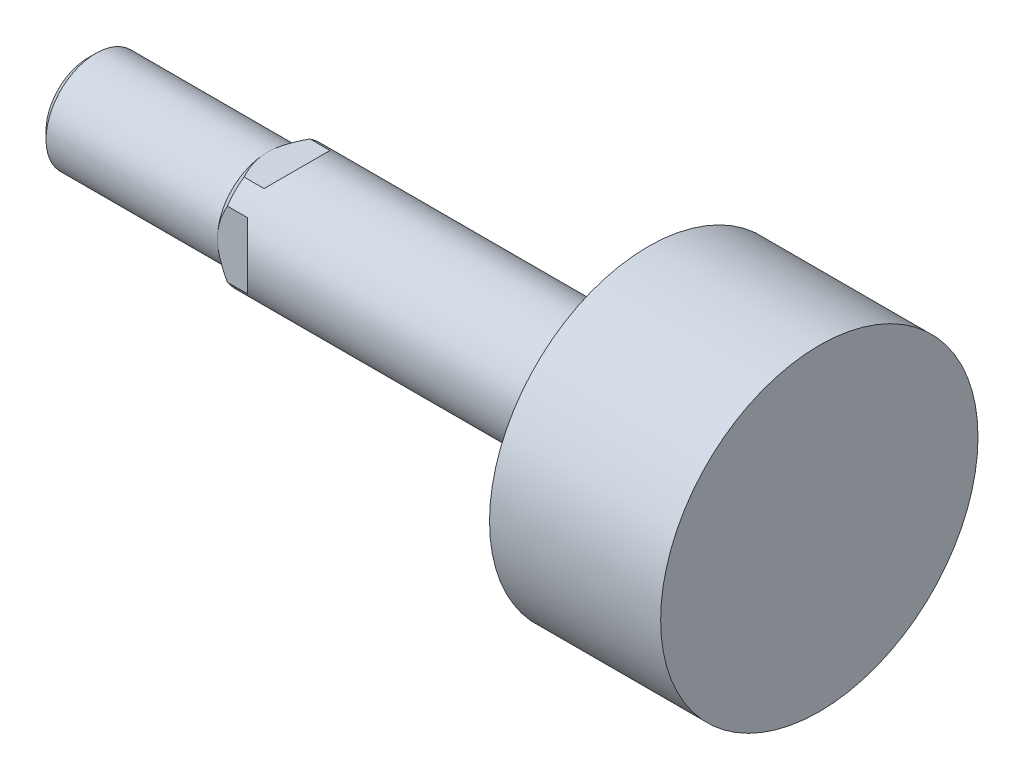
ISO-10303-21;
HEADER;
FILE_DESCRIPTION(('STEP AP214'),'2;1');
FILE_NAME('part.step','',(''),(''),'','','');
FILE_SCHEMA(('AUTOMOTIVE_DESIGN { 1 0 10303 214 1 1 1 1 }'));
ENDSEC;
DATA;
#1=APPLICATION_CONTEXT('core data for automotive mechanical design processes');
#2=APPLICATION_PROTOCOL_DEFINITION('international standard','automotive_design',2000,#1);
#3=PRODUCT_CONTEXT('',#1,'mechanical');
#4=PRODUCT('Part','Part','',(#3));
#5=PRODUCT_RELATED_PRODUCT_CATEGORY('part','',(#4));
#6=PRODUCT_DEFINITION_FORMATION('','',#4);
#7=PRODUCT_DEFINITION_CONTEXT('part definition',#1,'design');
#8=PRODUCT_DEFINITION('design','',#6,#7);
#9=PRODUCT_DEFINITION_SHAPE('','',#8);
#10=(LENGTH_UNIT() NAMED_UNIT(*) SI_UNIT(.MILLI.,.METRE.));
#11=(NAMED_UNIT(*) PLANE_ANGLE_UNIT() SI_UNIT($,.RADIAN.));
#12=(NAMED_UNIT(*) SI_UNIT($,.STERADIAN.) SOLID_ANGLE_UNIT());
#13=UNCERTAINTY_MEASURE_WITH_UNIT(LENGTH_MEASURE(1.E-05),#10,'distance_accuracy_value','');
#14=(GEOMETRIC_REPRESENTATION_CONTEXT(3) GLOBAL_UNCERTAINTY_ASSIGNED_CONTEXT((#13)) GLOBAL_UNIT_ASSIGNED_CONTEXT((#10,
#11,#12)) REPRESENTATION_CONTEXT('',''));
#15=CARTESIAN_POINT('',(0.,0.,0.));
#16=DIRECTION('',(0.,0.,1.));
#17=DIRECTION('',(1.,0.,0.));
#18=AXIS2_PLACEMENT_3D('',#15,#16,#17);
#19=CARTESIAN_POINT('',(-6.,0.,0.));
#20=DIRECTION('',(1.,0.,0.));
#21=DIRECTION('',(0.,0.,-1.));
#22=AXIS2_PLACEMENT_3D('',#19,#20,#21);
#23=CONICAL_SURFACE('',#22,6.,0.785398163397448);
#24=CARTESIAN_POINT('',(-6.,0.,0.));
#25=DIRECTION('',(-1.,0.,0.));
#26=DIRECTION('',(0.,0.,1.));
#27=AXIS2_PLACEMENT_3D('',#24,#25,#26);
#28=CIRCLE('',#27,6.);
#29=CARTESIAN_POINT('',(-6.,3.3166247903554,5.));
#30=VERTEX_POINT('',#29);
#31=CARTESIAN_POINT('',(-6.,5.,3.3166247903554));
#32=VERTEX_POINT('',#31);
#33=EDGE_CURVE('E120',#30,#32,#28,.T.);
#34=ORIENTED_EDGE('',*,*,#33,.T.);
#35=CARTESIAN_POINT('',(-1.60454480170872,5.,-9.11402703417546));
#36=CARTESIAN_POINT('',(-1.79364477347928,5.,-8.89830090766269));
#37=CARTESIAN_POINT('',(-1.98190727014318,5.,-8.68183266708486));
#38=CARTESIAN_POINT('',(-2.35630603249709,5.,-8.24701419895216));
#39=CARTESIAN_POINT('',(-2.54244199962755,5.,-8.02866371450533));
#40=CARTESIAN_POINT('',(-2.91316602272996,5.,-7.58845746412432));
#41=CARTESIAN_POINT('',(-3.09773863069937,5.,-7.36658865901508));
#42=CARTESIAN_POINT('',(-3.46351701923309,5.,-6.92011160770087));
#43=CARTESIAN_POINT('',(-3.6447230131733,5.,-6.6955035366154));
#44=CARTESIAN_POINT('',(-4.01639664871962,5.,-6.22576289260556));
#45=CARTESIAN_POINT('',(-4.20652795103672,5.,-5.98036302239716));
#46=CARTESIAN_POINT('',(-4.58021175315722,5.,-5.48450892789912));
#47=CARTESIAN_POINT('',(-4.76376291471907,5.,-5.23405369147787));
#48=CARTESIAN_POINT('',(-5.12138369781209,5.,-4.72732602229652));
#49=CARTESIAN_POINT('',(-5.29547588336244,5.,-4.47106970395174));
#50=CARTESIAN_POINT('',(-5.54700487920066,5.,-4.08056112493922));
#51=CARTESIAN_POINT('',(-5.62923296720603,5.,-3.94939408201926));
#52=CARTESIAN_POINT('',(-5.78983619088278,5.,-3.68472805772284));
#53=CARTESIAN_POINT('',(-5.86821173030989,5.,-3.55122932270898));
#54=CARTESIAN_POINT('',(-5.99561991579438,5.,-3.32539029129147));
#55=CARTESIAN_POINT('',(-6.04591585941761,5.,-3.23376316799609));
#56=CARTESIAN_POINT('',(-6.14409078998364,5.,-3.04922520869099));
#57=CARTESIAN_POINT('',(-6.19196976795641,5.,-2.95631436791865));
#58=CARTESIAN_POINT('',(-6.33152002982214,5.,-2.6754640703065));
#59=CARTESIAN_POINT('',(-6.41908451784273,5.,-2.48544199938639));
#60=CARTESIAN_POINT('',(-6.57902142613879,5.,-2.10167883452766));
#61=CARTESIAN_POINT('',(-6.65156138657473,5.,-1.90800837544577));
#62=CARTESIAN_POINT('',(-6.77885149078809,5.,-1.51488105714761));
#63=CARTESIAN_POINT('',(-6.83361207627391,5.,-1.31542766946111));
#64=CARTESIAN_POINT('',(-6.90932037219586,5.,-0.967191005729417));
#65=CARTESIAN_POINT('',(-6.93542358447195,5.,-0.819529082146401));
#66=CARTESIAN_POINT('',(-6.97492435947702,5.,-0.52251362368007));
#67=CARTESIAN_POINT('',(-6.98832463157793,5.,-0.373160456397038));
#68=CARTESIAN_POINT('',(-7.00167808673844,5.,-0.0741041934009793));
#69=CARTESIAN_POINT('',(-7.00165451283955,5.,0.0755978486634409));
#70=CARTESIAN_POINT('',(-6.98822522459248,5.,0.374410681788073));
#71=CARTESIAN_POINT('',(-6.97481717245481,5.,0.523521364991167));
#72=CARTESIAN_POINT('',(-6.93107757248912,5.,0.851961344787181));
#73=CARTESIAN_POINT('',(-6.89772509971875,5.,1.03088843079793));
#74=CARTESIAN_POINT('',(-6.81461946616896,5.,1.38486287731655));
#75=CARTESIAN_POINT('',(-6.76486062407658,5.,1.55990887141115));
#76=CARTESIAN_POINT('',(-6.65082104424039,5.,1.90820327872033));
#77=CARTESIAN_POINT('',(-6.58632421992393,5.,2.08138012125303));
#78=CARTESIAN_POINT('',(-6.48110877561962,5.,2.33756680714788));
#79=CARTESIAN_POINT('',(-6.44462869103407,5.,2.42235894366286));
#80=CARTESIAN_POINT('',(-6.36913788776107,5.,2.59080554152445));
#81=CARTESIAN_POINT('',(-6.33012729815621,5.,2.67446006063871));
#82=CARTESIAN_POINT('',(-6.2034832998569,5.,2.93670685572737));
#83=CARTESIAN_POINT('',(-6.11174535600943,5.,3.11332251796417));
#84=CARTESIAN_POINT('',(-5.9201216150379,5.,3.46210204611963));
#85=CARTESIAN_POINT('',(-5.82023294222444,5.,3.63426431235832));
#86=CARTESIAN_POINT('',(-5.61394517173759,5.,3.97493273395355));
#87=CARTESIAN_POINT('',(-5.50753772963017,5.,4.14343381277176));
#88=CARTESIAN_POINT('',(-5.289676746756,5.,4.47709665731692));
#89=CARTESIAN_POINT('',(-5.17822379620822,5.,4.64225881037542));
#90=CARTESIAN_POINT('',(-4.95054702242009,5.,4.97080519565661));
#91=CARTESIAN_POINT('',(-4.83429742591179,5.,5.13417151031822));
#92=CARTESIAN_POINT('',(-4.59846600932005,5.,5.45848543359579));
#93=CARTESIAN_POINT('',(-4.47888402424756,5.,5.6194329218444));
#94=CARTESIAN_POINT('',(-4.1162542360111,5.,6.09896717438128));
#95=CARTESIAN_POINT('',(-3.8691523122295,5.,6.41448750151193));
#96=CARTESIAN_POINT('',(-3.39688153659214,5.,7.00289492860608));
#97=CARTESIAN_POINT('',(-3.17253372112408,5.,7.27644693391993));
#98=CARTESIAN_POINT('',(-2.71942355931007,5.,7.8199503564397));
#99=CARTESIAN_POINT('',(-2.4906604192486,5.,8.08990111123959));
#100=CARTESIAN_POINT('',(-2.03285231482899,5.,8.62337380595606));
#101=CARTESIAN_POINT('',(-1.80385124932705,5.,8.88693353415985));
#102=CARTESIAN_POINT('',(-1.3433228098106,5.,9.41170985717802));
#103=CARTESIAN_POINT('',(-1.11179614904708,5.,9.67292707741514));
#104=CARTESIAN_POINT('',(-0.87930384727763,5.,9.93327151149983));
#105=B_SPLINE_CURVE_WITH_KNOTS('',3,(#35,#36,#37,#38,#39,#40,#41,#42,#43,#44,#45,#46,#47,#48,
#49,#50,#51,#52,#53,#54,#55,#56,#57,#58,#59,#60,#61,#62,#63,#64,#65,#66,#67,#68,#69,#70,#71,#72,
#73,#74,#75,#76,#77,#78,#79,#80,#81,#82,#83,#84,#85,#86,#87,#88,#89,#90,#91,#92,#93,#94,#95,#96,
#97,#98,#99,#100,#101,#102,#103,#104),.UNSPECIFIED.,.F.,.F.,(4,2,2,2,2,2,2,2,2,2,2,2,2,2,2,2,2,
2,2,2,2,2,2,2,2,2,2,2,2,2,2,2,2,2,4),(0.,0.860628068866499,1.72137551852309,2.58716357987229,
3.45289657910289,4.38412013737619,5.31553202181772,6.24461457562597,6.70899557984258,
7.17332781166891,7.48686552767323,7.8004044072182,8.42760354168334,9.04737944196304,
9.66679069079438,10.1161584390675,10.5654303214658,11.0139243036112,11.4624966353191,
12.0075988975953,12.552890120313,13.1067574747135,13.3836444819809,13.6605173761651,
14.2572699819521,14.8542340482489,15.4519789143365,16.0496540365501,16.6511194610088,
17.252614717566,18.4547185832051,19.5160214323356,20.5775168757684,21.6249470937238,
22.6720887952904),.UNSPECIFIED.);
#106=CARTESIAN_POINT('',(-7.,5.,0.));
#107=VERTEX_POINT('',#106);
#108=EDGE_CURVE('E230',#32,#107,#105,.F.);
#109=ORIENTED_EDGE('',*,*,#108,.T.);
#110=CARTESIAN_POINT('',(-7.,0.,0.));
#111=DIRECTION('',(-1.,0.,0.));
#112=DIRECTION('',(0.,0.,1.));
#113=AXIS2_PLACEMENT_3D('',#110,#111,#112);
#114=CIRCLE('',#113,5.);
#115=CARTESIAN_POINT('',(-7.,0.,5.));
#116=VERTEX_POINT('',#115);
#117=EDGE_CURVE('E126',#116,#107,#114,.T.);
#118=ORIENTED_EDGE('',*,*,#117,.F.);
#119=CARTESIAN_POINT('',(-0.991657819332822,-9.80732366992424,5.));
#120=CARTESIAN_POINT('',(-1.19308598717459,-9.58119349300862,5.));
#121=CARTESIAN_POINT('',(-1.39374916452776,-9.3543754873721,5.));
#122=CARTESIAN_POINT('',(-1.79313740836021,-8.89899928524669,5.));
#123=CARTESIAN_POINT('',(-1.9918622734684,-8.67044091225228,5.));
#124=CARTESIAN_POINT('',(-2.38775313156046,-8.21030230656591,5.));
#125=CARTESIAN_POINT('',(-2.58490908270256,-7.97871341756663,5.));
#126=CARTESIAN_POINT('',(-2.97618633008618,-7.51300057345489,5.));
#127=CARTESIAN_POINT('',(-3.17030776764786,-7.278876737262,5.));
#128=CARTESIAN_POINT('',(-3.56622965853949,-6.79333741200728,5.));
#129=CARTESIAN_POINT('',(-3.76779214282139,-6.54172718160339,5.));
#130=CARTESIAN_POINT('',(-4.16517546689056,-6.03402447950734,5.));
#131=CARTESIAN_POINT('',(-4.36099666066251,-5.77793228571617,5.));
#132=CARTESIAN_POINT('',(-4.74456171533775,-5.26038239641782,5.));
#133=CARTESIAN_POINT('',(-4.93231861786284,-4.99893445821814,5.));
#134=CARTESIAN_POINT('',(-5.20576313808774,-4.60117964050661,5.));
#135=CARTESIAN_POINT('',(-5.29553526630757,-4.46768156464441,5.));
#136=CARTESIAN_POINT('',(-5.4717999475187,-4.1985412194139,5.));
#137=CARTESIAN_POINT('',(-5.55829262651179,-4.06289903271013,5.));
#138=CARTESIAN_POINT('',(-5.76184057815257,-3.73331659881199,5.));
#139=CARTESIAN_POINT('',(-5.87696553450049,-3.53817282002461,5.));
#140=CARTESIAN_POINT('',(-6.09699630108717,-3.14206624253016,5.));
#141=CARTESIAN_POINT('',(-6.2018988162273,-2.94110159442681,5.));
#142=CARTESIAN_POINT('',(-6.39721135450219,-2.53432452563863,5.));
#143=CARTESIAN_POINT('',(-6.487739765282,-2.32856965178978,5.));
#144=CARTESIAN_POINT('',(-6.65102786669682,-1.91010569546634,5.));
#145=CARTESIAN_POINT('',(-6.72379941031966,-1.69740135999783,5.));
#146=CARTESIAN_POINT('',(-6.82651229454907,-1.33583757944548,5.));
#147=CARTESIAN_POINT('',(-6.86268358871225,-1.18875094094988,5.));
#148=CARTESIAN_POINT('',(-6.92310669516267,-0.892133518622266,5.));
#149=CARTESIAN_POINT('',(-6.947360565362,-0.742603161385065,5.));
#150=CARTESIAN_POINT('',(-6.98265981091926,-0.442508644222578,5.));
#151=CARTESIAN_POINT('',(-6.9937518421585,-0.29195005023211,5.));
#152=CARTESIAN_POINT('',(-7.00226176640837,0.00956074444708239,5.));
#153=CARTESIAN_POINT('',(-6.99967962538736,0.160512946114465,5.));
#154=CARTESIAN_POINT('',(-6.98103618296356,0.460821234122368,5.));
#155=CARTESIAN_POINT('',(-6.96504136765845,0.610181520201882,5.));
#156=CARTESIAN_POINT('',(-6.92051704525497,0.907029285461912,5.));
#157=CARTESIAN_POINT('',(-6.89198456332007,1.05451631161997,5.));
#158=CARTESIAN_POINT('',(-6.82334280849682,1.34850138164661,5.));
#159=CARTESIAN_POINT('',(-6.78310600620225,1.49496927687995,5.));
#160=CARTESIAN_POINT('',(-6.69279349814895,1.78477023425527,5.));
#161=CARTESIAN_POINT('',(-6.64271960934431,1.92810386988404,5.));
#162=CARTESIAN_POINT('',(-6.5163267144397,2.25856233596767,5.));
#163=CARTESIAN_POINT('',(-6.43680941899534,2.4444583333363,5.));
#164=CARTESIAN_POINT('',(-6.26631467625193,2.81095841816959,5.));
#165=CARTESIAN_POINT('',(-6.17533094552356,2.99155953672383,5.));
#166=CARTESIAN_POINT('',(-5.98414651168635,3.348627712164,5.));
#167=CARTESIAN_POINT('',(-5.88391331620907,3.52507723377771,5.));
#168=CARTESIAN_POINT('',(-5.67651131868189,3.87377641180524,5.));
#169=CARTESIAN_POINT('',(-5.56934386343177,4.04602687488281,5.));
#170=CARTESIAN_POINT('',(-5.35501877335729,4.37848116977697,5.));
#171=CARTESIAN_POINT('',(-5.24812715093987,4.53885738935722,5.));
#172=CARTESIAN_POINT('',(-5.03035517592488,4.85688884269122,5.));
#173=CARTESIAN_POINT('',(-4.91947450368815,5.01454385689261,5.));
#174=CARTESIAN_POINT('',(-4.69547393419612,5.32613837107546,5.));
#175=CARTESIAN_POINT('',(-4.58238248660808,5.48009839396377,5.));
#176=CARTESIAN_POINT('',(-4.35358630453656,5.78600281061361,5.));
#177=CARTESIAN_POINT('',(-4.23788227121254,5.93794772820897,5.));
#178=CARTESIAN_POINT('',(-4.12112335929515,6.08906373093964,5.));
#179=B_SPLINE_CURVE_WITH_KNOTS('',3,(#119,#120,#121,#122,#123,#124,#125,#126,#127,#128,#129,
#130,#131,#132,#133,#134,#135,#136,#137,#138,#139,#140,#141,#142,#143,#144,#145,#146,#147,#148,
#149,#150,#151,#152,#153,#154,#155,#156,#157,#158,#159,#160,#161,#162,#163,#164,#165,#166,#167,
#168,#169,#170,#171,#172,#173,#174,#175,#176,#177,#178),.UNSPECIFIED.,.F.,.F.,(4,2,2,2,2,2,2,2,
2,2,2,2,2,2,2,2,2,2,2,2,2,2,2,2,2,2,2,2,2,4),(0.,0.908506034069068,1.81710546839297,
2.72951794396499,3.6418878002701,4.60899241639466,5.57603727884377,6.54145432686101,
7.02404000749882,7.50660712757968,8.18608499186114,8.86578115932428,9.53955092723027,
10.2128697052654,10.6668587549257,11.1207693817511,11.5730661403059,12.0253640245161,
12.4754330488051,12.9256089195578,13.3808863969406,13.8360798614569,14.4421198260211,
15.0484933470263,15.6570845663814,16.2655579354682,16.8436881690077,17.421864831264,
17.9949317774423,18.5678467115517),.UNSPECIFIED.);
#180=EDGE_CURVE('E146',#116,#30,#179,.T.);
#181=ORIENTED_EDGE('',*,*,#180,.T.);
#182=EDGE_LOOP('',(#34,#109,#118,#181));
#183=FACE_BOUND('',#182,.T.);
#184=ADVANCED_FACE('F16',(#183),#23,.T.);
#185=CARTESIAN_POINT('',(-6.,-3.3166247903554,-5.));
#186=VERTEX_POINT('',#185);
#187=CARTESIAN_POINT('',(-6.,-5.,-3.3166247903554));
#188=VERTEX_POINT('',#187);
#189=EDGE_CURVE('E109',#186,#188,#28,.T.);
#190=ORIENTED_EDGE('',*,*,#189,.T.);
#191=CARTESIAN_POINT('',(-1.60454480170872,-5.,-9.11402703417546));
#192=CARTESIAN_POINT('',(-1.79364477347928,-5.,-8.89830090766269));
#193=CARTESIAN_POINT('',(-1.98190727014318,-5.,-8.68183266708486));
#194=CARTESIAN_POINT('',(-2.35630603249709,-5.,-8.24701419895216));
#195=CARTESIAN_POINT('',(-2.54244199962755,-5.,-8.02866371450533));
#196=CARTESIAN_POINT('',(-2.91316602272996,-5.,-7.58845746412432));
#197=CARTESIAN_POINT('',(-3.09773863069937,-5.,-7.36658865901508));
#198=CARTESIAN_POINT('',(-3.46351701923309,-5.,-6.92011160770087));
#199=CARTESIAN_POINT('',(-3.6447230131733,-5.,-6.6955035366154));
#200=CARTESIAN_POINT('',(-4.01639664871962,-5.,-6.22576289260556));
#201=CARTESIAN_POINT('',(-4.20652795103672,-5.,-5.98036302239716));
#202=CARTESIAN_POINT('',(-4.58021175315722,-5.,-5.48450892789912));
#203=CARTESIAN_POINT('',(-4.76376291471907,-5.,-5.23405369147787));
#204=CARTESIAN_POINT('',(-5.12138369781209,-5.,-4.72732602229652));
#205=CARTESIAN_POINT('',(-5.29547588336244,-5.,-4.47106970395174));
#206=CARTESIAN_POINT('',(-5.54700487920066,-5.,-4.08056112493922));
#207=CARTESIAN_POINT('',(-5.62923296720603,-5.,-3.94939408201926));
#208=CARTESIAN_POINT('',(-5.78983619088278,-5.,-3.68472805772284));
#209=CARTESIAN_POINT('',(-5.86821173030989,-5.,-3.55122932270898));
#210=CARTESIAN_POINT('',(-5.99561991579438,-5.,-3.32539029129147));
#211=CARTESIAN_POINT('',(-6.04591585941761,-5.,-3.23376316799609));
#212=CARTESIAN_POINT('',(-6.14409078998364,-5.,-3.04922520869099));
#213=CARTESIAN_POINT('',(-6.19196976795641,-5.,-2.95631436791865));
#214=CARTESIAN_POINT('',(-6.33152002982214,-5.,-2.6754640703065));
#215=CARTESIAN_POINT('',(-6.41908451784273,-5.,-2.48544199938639));
#216=CARTESIAN_POINT('',(-6.57902142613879,-5.,-2.10167883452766));
#217=CARTESIAN_POINT('',(-6.65156138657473,-5.,-1.90800837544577));
#218=CARTESIAN_POINT('',(-6.77885149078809,-5.,-1.51488105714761));
#219=CARTESIAN_POINT('',(-6.83361207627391,-5.,-1.31542766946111));
#220=CARTESIAN_POINT('',(-6.90932037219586,-5.,-0.967191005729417));
#221=CARTESIAN_POINT('',(-6.93542358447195,-5.,-0.819529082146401));
#222=CARTESIAN_POINT('',(-6.97492435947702,-5.,-0.52251362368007));
#223=CARTESIAN_POINT('',(-6.98832463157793,-5.,-0.373160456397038));
#224=CARTESIAN_POINT('',(-7.00167808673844,-5.,-0.0741041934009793));
#225=CARTESIAN_POINT('',(-7.00165451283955,-5.,0.0755978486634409));
#226=CARTESIAN_POINT('',(-6.98822522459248,-5.,0.374410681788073));
#227=CARTESIAN_POINT('',(-6.97481717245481,-5.,0.523521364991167));
#228=CARTESIAN_POINT('',(-6.93107757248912,-5.,0.851961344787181));
#229=CARTESIAN_POINT('',(-6.89772509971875,-5.,1.03088843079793));
#230=CARTESIAN_POINT('',(-6.81461946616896,-5.,1.38486287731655));
#231=CARTESIAN_POINT('',(-6.76486062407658,-5.,1.55990887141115));
#232=CARTESIAN_POINT('',(-6.65082104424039,-5.,1.90820327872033));
#233=CARTESIAN_POINT('',(-6.58632421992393,-5.,2.08138012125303));
#234=CARTESIAN_POINT('',(-6.48110877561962,-5.,2.33756680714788));
#235=CARTESIAN_POINT('',(-6.44462869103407,-5.,2.42235894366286));
#236=CARTESIAN_POINT('',(-6.36913788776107,-5.,2.59080554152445));
#237=CARTESIAN_POINT('',(-6.33012729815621,-5.,2.67446006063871));
#238=CARTESIAN_POINT('',(-6.2034832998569,-5.,2.93670685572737));
#239=CARTESIAN_POINT('',(-6.11174535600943,-5.,3.11332251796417));
#240=CARTESIAN_POINT('',(-5.9201216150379,-5.,3.46210204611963));
#241=CARTESIAN_POINT('',(-5.82023294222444,-5.,3.63426431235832));
#242=CARTESIAN_POINT('',(-5.61394517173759,-5.,3.97493273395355));
#243=CARTESIAN_POINT('',(-5.50753772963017,-5.,4.14343381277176));
#244=CARTESIAN_POINT('',(-5.289676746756,-5.,4.47709665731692));
#245=CARTESIAN_POINT('',(-5.17822379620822,-5.,4.64225881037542));
#246=CARTESIAN_POINT('',(-4.95054702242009,-5.,4.97080519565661));
#247=CARTESIAN_POINT('',(-4.83429742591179,-5.,5.13417151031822));
#248=CARTESIAN_POINT('',(-4.59846600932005,-5.,5.45848543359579));
#249=CARTESIAN_POINT('',(-4.47888402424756,-5.,5.6194329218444));
#250=CARTESIAN_POINT('',(-4.1162542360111,-5.,6.09896717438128));
#251=CARTESIAN_POINT('',(-3.8691523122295,-5.,6.41448750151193));
#252=CARTESIAN_POINT('',(-3.39688153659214,-5.,7.00289492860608));
#253=CARTESIAN_POINT('',(-3.17253372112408,-5.,7.27644693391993));
#254=CARTESIAN_POINT('',(-2.71942355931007,-5.,7.8199503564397));
#255=CARTESIAN_POINT('',(-2.4906604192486,-5.,8.08990111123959));
#256=CARTESIAN_POINT('',(-2.03285231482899,-5.,8.62337380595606));
#257=CARTESIAN_POINT('',(-1.80385124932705,-5.,8.88693353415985));
#258=CARTESIAN_POINT('',(-1.3433228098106,-5.,9.41170985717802));
#259=CARTESIAN_POINT('',(-1.11179614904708,-5.,9.67292707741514));
#260=CARTESIAN_POINT('',(-0.87930384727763,-5.,9.93327151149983));
#261=B_SPLINE_CURVE_WITH_KNOTS('',3,(#191,#192,#193,#194,#195,#196,#197,#198,#199,#200,#201,
#202,#203,#204,#205,#206,#207,#208,#209,#210,#211,#212,#213,#214,#215,#216,#217,#218,#219,#220,
#221,#222,#223,#224,#225,#226,#227,#228,#229,#230,#231,#232,#233,#234,#235,#236,#237,#238,#239,
#240,#241,#242,#243,#244,#245,#246,#247,#248,#249,#250,#251,#252,#253,#254,#255,#256,#257,#258,
#259,#260),.UNSPECIFIED.,.F.,.F.,(4,2,2,2,2,2,2,2,2,2,2,2,2,2,2,2,2,2,2,2,2,2,2,2,2,2,2,2,2,2,2,
2,2,2,4),(0.,0.860628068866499,1.72137551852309,2.58716357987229,3.45289657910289,
4.38412013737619,5.31553202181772,6.24461457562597,6.70899557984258,7.17332781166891,
7.48686552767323,7.8004044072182,8.42760354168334,9.04737944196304,9.66679069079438,
10.1161584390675,10.5654303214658,11.0139243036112,11.4624966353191,12.0075988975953,
12.552890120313,13.1067574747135,13.3836444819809,13.6605173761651,14.2572699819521,
14.8542340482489,15.4519789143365,16.0496540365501,16.6511194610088,17.252614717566,
18.4547185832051,19.5160214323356,20.5775168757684,21.6249470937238,22.6720887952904),.UNSPECIFIED.);
#262=CARTESIAN_POINT('',(-7.,-5.,0.));
#263=VERTEX_POINT('',#262);
#264=EDGE_CURVE('E94',#188,#263,#261,.T.);
#265=ORIENTED_EDGE('',*,*,#264,.T.);
#266=CARTESIAN_POINT('',(-7.,0.,-5.));
#267=VERTEX_POINT('',#266);
#268=EDGE_CURVE('E107',#267,#263,#114,.T.);
#269=ORIENTED_EDGE('',*,*,#268,.F.);
#270=CARTESIAN_POINT('',(-0.991657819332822,-9.80732366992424,-5.));
#271=CARTESIAN_POINT('',(-1.19308598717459,-9.58119349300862,-5.));
#272=CARTESIAN_POINT('',(-1.39374916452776,-9.3543754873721,-5.));
#273=CARTESIAN_POINT('',(-1.79313740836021,-8.89899928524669,-5.));
#274=CARTESIAN_POINT('',(-1.9918622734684,-8.67044091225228,-5.));
#275=CARTESIAN_POINT('',(-2.38775313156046,-8.21030230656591,-5.));
#276=CARTESIAN_POINT('',(-2.58490908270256,-7.97871341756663,-5.));
#277=CARTESIAN_POINT('',(-2.97618633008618,-7.51300057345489,-5.));
#278=CARTESIAN_POINT('',(-3.17030776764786,-7.278876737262,-5.));
#279=CARTESIAN_POINT('',(-3.56622965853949,-6.79333741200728,-5.));
#280=CARTESIAN_POINT('',(-3.76779214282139,-6.54172718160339,-5.));
#281=CARTESIAN_POINT('',(-4.16517546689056,-6.03402447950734,-5.));
#282=CARTESIAN_POINT('',(-4.36099666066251,-5.77793228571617,-5.));
#283=CARTESIAN_POINT('',(-4.74456171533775,-5.26038239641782,-5.));
#284=CARTESIAN_POINT('',(-4.93231861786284,-4.99893445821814,-5.));
#285=CARTESIAN_POINT('',(-5.20576313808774,-4.60117964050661,-5.));
#286=CARTESIAN_POINT('',(-5.29553526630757,-4.46768156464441,-5.));
#287=CARTESIAN_POINT('',(-5.4717999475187,-4.1985412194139,-5.));
#288=CARTESIAN_POINT('',(-5.55829262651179,-4.06289903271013,-5.));
#289=CARTESIAN_POINT('',(-5.76184057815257,-3.73331659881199,-5.));
#290=CARTESIAN_POINT('',(-5.87696553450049,-3.53817282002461,-5.));
#291=CARTESIAN_POINT('',(-6.09699630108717,-3.14206624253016,-5.));
#292=CARTESIAN_POINT('',(-6.2018988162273,-2.94110159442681,-5.));
#293=CARTESIAN_POINT('',(-6.39721135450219,-2.53432452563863,-5.));
#294=CARTESIAN_POINT('',(-6.487739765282,-2.32856965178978,-5.));
#295=CARTESIAN_POINT('',(-6.65102786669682,-1.91010569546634,-5.));
#296=CARTESIAN_POINT('',(-6.72379941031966,-1.69740135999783,-5.));
#297=CARTESIAN_POINT('',(-6.82651229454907,-1.33583757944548,-5.));
#298=CARTESIAN_POINT('',(-6.86268358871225,-1.18875094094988,-5.));
#299=CARTESIAN_POINT('',(-6.92310669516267,-0.892133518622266,-5.));
#300=CARTESIAN_POINT('',(-6.947360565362,-0.742603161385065,-5.));
#301=CARTESIAN_POINT('',(-6.98265981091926,-0.442508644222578,-5.));
#302=CARTESIAN_POINT('',(-6.9937518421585,-0.29195005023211,-5.));
#303=CARTESIAN_POINT('',(-7.00226176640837,0.00956074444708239,-5.));
#304=CARTESIAN_POINT('',(-6.99967962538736,0.160512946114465,-5.));
#305=CARTESIAN_POINT('',(-6.98103618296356,0.460821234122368,-5.));
#306=CARTESIAN_POINT('',(-6.96504136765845,0.610181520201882,-5.));
#307=CARTESIAN_POINT('',(-6.92051704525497,0.907029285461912,-5.));
#308=CARTESIAN_POINT('',(-6.89198456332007,1.05451631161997,-5.));
#309=CARTESIAN_POINT('',(-6.82334280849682,1.34850138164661,-5.));
#310=CARTESIAN_POINT('',(-6.78310600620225,1.49496927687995,-5.));
#311=CARTESIAN_POINT('',(-6.69279349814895,1.78477023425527,-5.));
#312=CARTESIAN_POINT('',(-6.64271960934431,1.92810386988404,-5.));
#313=CARTESIAN_POINT('',(-6.5163267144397,2.25856233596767,-5.));
#314=CARTESIAN_POINT('',(-6.43680941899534,2.4444583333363,-5.));
#315=CARTESIAN_POINT('',(-6.26631467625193,2.81095841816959,-5.));
#316=CARTESIAN_POINT('',(-6.17533094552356,2.99155953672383,-5.));
#317=CARTESIAN_POINT('',(-5.98414651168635,3.348627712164,-5.));
#318=CARTESIAN_POINT('',(-5.88391331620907,3.52507723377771,-5.));
#319=CARTESIAN_POINT('',(-5.67651131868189,3.87377641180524,-5.));
#320=CARTESIAN_POINT('',(-5.56934386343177,4.04602687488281,-5.));
#321=CARTESIAN_POINT('',(-5.35501877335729,4.37848116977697,-5.));
#322=CARTESIAN_POINT('',(-5.24812715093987,4.53885738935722,-5.));
#323=CARTESIAN_POINT('',(-5.03035517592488,4.85688884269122,-5.));
#324=CARTESIAN_POINT('',(-4.91947450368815,5.01454385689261,-5.));
#325=CARTESIAN_POINT('',(-4.69547393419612,5.32613837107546,-5.));
#326=CARTESIAN_POINT('',(-4.58238248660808,5.48009839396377,-5.));
#327=CARTESIAN_POINT('',(-4.35358630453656,5.78600281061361,-5.));
#328=CARTESIAN_POINT('',(-4.23788227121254,5.93794772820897,-5.));
#329=CARTESIAN_POINT('',(-4.12112335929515,6.08906373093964,-5.));
#330=B_SPLINE_CURVE_WITH_KNOTS('',3,(#270,#271,#272,#273,#274,#275,#276,#277,#278,#279,#280,
#281,#282,#283,#284,#285,#286,#287,#288,#289,#290,#291,#292,#293,#294,#295,#296,#297,#298,#299,
#300,#301,#302,#303,#304,#305,#306,#307,#308,#309,#310,#311,#312,#313,#314,#315,#316,#317,#318,
#319,#320,#321,#322,#323,#324,#325,#326,#327,#328,#329),.UNSPECIFIED.,.F.,.F.,(4,2,2,2,2,2,2,2,
2,2,2,2,2,2,2,2,2,2,2,2,2,2,2,2,2,2,2,2,2,4),(0.,0.908506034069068,1.81710546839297,
2.72951794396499,3.6418878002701,4.60899241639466,5.57603727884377,6.54145432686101,
7.02404000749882,7.50660712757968,8.18608499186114,8.86578115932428,9.53955092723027,
10.2128697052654,10.6668587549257,11.1207693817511,11.5730661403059,12.0253640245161,
12.4754330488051,12.9256089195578,13.3808863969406,13.8360798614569,14.4421198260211,
15.0484933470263,15.6570845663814,16.2655579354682,16.8436881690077,17.421864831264,
17.9949317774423,18.5678467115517),.UNSPECIFIED.);
#331=EDGE_CURVE('E155',#267,#186,#330,.F.);
#332=ORIENTED_EDGE('',*,*,#331,.T.);
#333=EDGE_LOOP('',(#190,#265,#269,#332));
#334=FACE_BOUND('',#333,.T.);
#335=ADVANCED_FACE('F104',(#334),#23,.T.);
#336=EDGE_CURVE('E122',#107,#267,#114,.T.);
#337=ORIENTED_EDGE('',*,*,#336,.F.);
#338=CARTESIAN_POINT('',(-6.,5.,-3.3166247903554));
#339=VERTEX_POINT('',#338);
#340=EDGE_CURVE('E209',#107,#339,#105,.F.);
#341=ORIENTED_EDGE('',*,*,#340,.T.);
#342=CARTESIAN_POINT('',(-6.,3.3166247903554,-5.));
#343=VERTEX_POINT('',#342);
#344=EDGE_CURVE('E213',#339,#343,#28,.T.);
#345=ORIENTED_EDGE('',*,*,#344,.T.);
#346=EDGE_CURVE('E212',#343,#267,#330,.F.);
#347=ORIENTED_EDGE('',*,*,#346,.T.);
#348=EDGE_LOOP('',(#337,#341,#345,#347));
#349=FACE_BOUND('',#348,.T.);
#350=ADVANCED_FACE('F189',(#349),#23,.T.);
#351=CARTESIAN_POINT('',(48.5,0.,0.));
#352=DIRECTION('',(-1.,0.,0.));
#353=DIRECTION('',(0.,0.,1.));
#354=AXIS2_PLACEMENT_3D('',#351,#352,#353);
#355=CYLINDRICAL_SURFACE('',#354,6.);
#356=CARTESIAN_POINT('',(31.3,0.,0.));
#357=DIRECTION('',(-1.,0.,0.));
#358=DIRECTION('',(0.,0.,1.));
#359=AXIS2_PLACEMENT_3D('',#356,#357,#358);
#360=CIRCLE('',#359,6.);
#361=CARTESIAN_POINT('',(31.3,0.,6.));
#362=VERTEX_POINT('',#361);
#363=EDGE_CURVE('E143',#362,#362,#360,.T.);
#364=ORIENTED_EDGE('',*,*,#363,.T.);
#365=EDGE_LOOP('',(#364));
#366=FACE_BOUND('',#365,.T.);
#367=CARTESIAN_POINT('',(-9.,0.,0.));
#368=DIRECTION('',(0.707106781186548,-0.707106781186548,0.));
#369=DIRECTION('',(-0.707106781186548,-0.707106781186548,0.));
#370=AXIS2_PLACEMENT_3D('',#367,#368,#369);
#371=ELLIPSE('',#370,8.48528137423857,6.);
#372=CARTESIAN_POINT('',(-4.,5.,-3.3166247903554));
#373=VERTEX_POINT('',#372);
#374=CARTESIAN_POINT('',(-4.,5.,3.3166247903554));
#375=VERTEX_POINT('',#374);
#376=EDGE_CURVE('E24',#373,#375,#371,.T.);
#377=ORIENTED_EDGE('',*,*,#376,.T.);
#378=DIRECTION('',(-1.,0.,0.));
#379=VECTOR('',#378,1.);
#380=CARTESIAN_POINT('',(48.5,5.,3.3166247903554));
#381=LINE('',#380,#379);
#382=EDGE_CURVE('E11',#375,#32,#381,.T.);
#383=ORIENTED_EDGE('',*,*,#382,.T.);
#384=ORIENTED_EDGE('',*,*,#33,.F.);
#385=DIRECTION('',(-1.,0.,0.));
#386=VECTOR('',#385,1.);
#387=CARTESIAN_POINT('',(48.5,3.3166247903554,5.));
#388=LINE('',#387,#386);
#389=CARTESIAN_POINT('',(-4.,3.31662479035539,5.));
#390=VERTEX_POINT('',#389);
#391=EDGE_CURVE('E232',#30,#390,#388,.F.);
#392=ORIENTED_EDGE('',*,*,#391,.T.);
#393=CARTESIAN_POINT('',(-9.,0.,0.));
#394=DIRECTION('',(0.707106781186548,0.,-0.707106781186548));
#395=DIRECTION('',(-0.707106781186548,0.,-0.707106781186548));
#396=AXIS2_PLACEMENT_3D('',#393,#394,#395);
#397=ELLIPSE('',#396,8.48528137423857,6.);
#398=CARTESIAN_POINT('',(-4.,-3.31662479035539,5.));
#399=VERTEX_POINT('',#398);
#400=EDGE_CURVE('E216',#390,#399,#397,.T.);
#401=ORIENTED_EDGE('',*,*,#400,.T.);
#402=DIRECTION('',(-1.,0.,0.));
#403=VECTOR('',#402,1.);
#404=CARTESIAN_POINT('',(48.5,-3.3166247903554,5.));
#405=LINE('',#404,#403);
#406=CARTESIAN_POINT('',(-6.,-3.3166247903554,5.));
#407=VERTEX_POINT('',#406);
#408=EDGE_CURVE('E269',#399,#407,#405,.T.);
#409=ORIENTED_EDGE('',*,*,#408,.T.);
#410=CARTESIAN_POINT('',(-6.,-5.,3.3166247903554));
#411=VERTEX_POINT('',#410);
#412=EDGE_CURVE('E225',#411,#407,#28,.T.);
#413=ORIENTED_EDGE('',*,*,#412,.F.);
#414=DIRECTION('',(-1.,0.,0.));
#415=VECTOR('',#414,1.);
#416=CARTESIAN_POINT('',(48.5,-5.,3.3166247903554));
#417=LINE('',#416,#415);
#418=CARTESIAN_POINT('',(-4.,-5.,3.31662479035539));
#419=VERTEX_POINT('',#418);
#420=EDGE_CURVE('E39',#411,#419,#417,.F.);
#421=ORIENTED_EDGE('',*,*,#420,.T.);
#422=CARTESIAN_POINT('',(-9.,0.,0.));
#423=DIRECTION('',(0.707106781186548,0.707106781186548,0.));
#424=DIRECTION('',(-0.707106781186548,0.707106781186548,0.));
#425=AXIS2_PLACEMENT_3D('',#422,#423,#424);
#426=ELLIPSE('',#425,8.48528137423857,6.);
#427=CARTESIAN_POINT('',(-4.,-5.,-3.31662479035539));
#428=VERTEX_POINT('',#427);
#429=EDGE_CURVE('E110',#419,#428,#426,.T.);
#430=ORIENTED_EDGE('',*,*,#429,.T.);
#431=DIRECTION('',(-1.,0.,0.));
#432=VECTOR('',#431,1.);
#433=CARTESIAN_POINT('',(48.5,-5.,-3.3166247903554));
#434=LINE('',#433,#432);
#435=EDGE_CURVE('E224',#428,#188,#434,.T.);
#436=ORIENTED_EDGE('',*,*,#435,.T.);
#437=ORIENTED_EDGE('',*,*,#189,.F.);
#438=DIRECTION('',(-1.,0.,0.));
#439=VECTOR('',#438,1.);
#440=CARTESIAN_POINT('',(48.5,-3.3166247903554,-5.));
#441=LINE('',#440,#439);
#442=CARTESIAN_POINT('',(-4.,-3.3166247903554,-5.));
#443=VERTEX_POINT('',#442);
#444=EDGE_CURVE('E222',#186,#443,#441,.F.);
#445=ORIENTED_EDGE('',*,*,#444,.T.);
#446=CARTESIAN_POINT('',(-9.,0.,0.));
#447=DIRECTION('',(0.707106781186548,0.,0.707106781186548));
#448=DIRECTION('',(-0.707106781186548,0.,0.707106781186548));
#449=AXIS2_PLACEMENT_3D('',#446,#447,#448);
#450=ELLIPSE('',#449,8.48528137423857,6.);
#451=CARTESIAN_POINT('',(-4.,3.3166247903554,-5.));
#452=VERTEX_POINT('',#451);
#453=EDGE_CURVE('E99',#443,#452,#450,.T.);
#454=ORIENTED_EDGE('',*,*,#453,.T.);
#455=DIRECTION('',(-1.,0.,0.));
#456=VECTOR('',#455,1.);
#457=CARTESIAN_POINT('',(48.5,3.3166247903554,-5.));
#458=LINE('',#457,#456);
#459=EDGE_CURVE('E226',#452,#343,#458,.T.);
#460=ORIENTED_EDGE('',*,*,#459,.T.);
#461=ORIENTED_EDGE('',*,*,#344,.F.);
#462=DIRECTION('',(-1.,0.,0.));
#463=VECTOR('',#462,1.);
#464=CARTESIAN_POINT('',(48.5,5.,-3.3166247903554));
#465=LINE('',#464,#463);
#466=EDGE_CURVE('E266',#339,#373,#465,.F.);
#467=ORIENTED_EDGE('',*,*,#466,.T.);
#468=EDGE_LOOP('',(#377,#383,#384,#392,#401,#409,#413,#421,#430,#436,#437,#445,#454,#460,#461,#467));
#469=FACE_BOUND('',#468,.T.);
#470=ADVANCED_FACE('F18',(#366,#469),#355,.T.);
#471=CARTESIAN_POINT('',(31.3,6.,0.));
#472=DIRECTION('',(1.,0.,0.));
#473=DIRECTION('',(0.,0.,-1.));
#474=AXIS2_PLACEMENT_3D('',#471,#472,#473);
#475=PLANE('',#474);
#476=ORIENTED_EDGE('',*,*,#363,.F.);
#477=EDGE_LOOP('',(#476));
#478=FACE_BOUND('',#477,.T.);
#479=CARTESIAN_POINT('',(31.3,0.,0.));
#480=DIRECTION('',(-1.,0.,0.));
#481=DIRECTION('',(0.,0.,1.));
#482=AXIS2_PLACEMENT_3D('',#479,#480,#481);
#483=CIRCLE('',#482,15.95);
#484=CARTESIAN_POINT('',(31.3,0.,15.95));
#485=VERTEX_POINT('',#484);
#486=EDGE_CURVE('E140',#485,#485,#483,.T.);
#487=ORIENTED_EDGE('',*,*,#486,.T.);
#488=EDGE_LOOP('',(#487));
#489=FACE_BOUND('',#488,.T.);
#490=ADVANCED_FACE('F205',(#478,#489),#475,.F.);
#491=CARTESIAN_POINT('',(48.5,0.,0.));
#492=DIRECTION('',(-1.,0.,0.));
#493=DIRECTION('',(0.,0.,1.));
#494=AXIS2_PLACEMENT_3D('',#491,#492,#493);
#495=CYLINDRICAL_SURFACE('',#494,15.95);
#496=ORIENTED_EDGE('',*,*,#486,.F.);
#497=EDGE_LOOP('',(#496));
#498=FACE_BOUND('',#497,.T.);
#499=CARTESIAN_POINT('',(48.5,0.,0.));
#500=DIRECTION('',(-1.,0.,0.));
#501=DIRECTION('',(0.,0.,1.));
#502=AXIS2_PLACEMENT_3D('',#499,#500,#501);
#503=CIRCLE('',#502,15.95);
#504=CARTESIAN_POINT('',(48.5,0.,15.95));
#505=VERTEX_POINT('',#504);
#506=EDGE_CURVE('E135',#505,#505,#503,.T.);
#507=ORIENTED_EDGE('',*,*,#506,.T.);
#508=EDGE_LOOP('',(#507));
#509=FACE_BOUND('',#508,.T.);
#510=ADVANCED_FACE('F340',(#498,#509),#495,.T.);
#511=CARTESIAN_POINT('',(48.5,15.95,0.));
#512=DIRECTION('',(-1.,0.,0.));
#513=DIRECTION('',(0.,0.,1.));
#514=AXIS2_PLACEMENT_3D('',#511,#512,#513);
#515=PLANE('',#514);
#516=ORIENTED_EDGE('',*,*,#506,.F.);
#517=EDGE_LOOP('',(#516));
#518=FACE_BOUND('',#517,.T.);
#519=ADVANCED_FACE('F346',(#518),#515,.F.);
#520=CARTESIAN_POINT('',(-25.,0.,0.));
#521=DIRECTION('',(1.,0.,0.));
#522=DIRECTION('',(0.,0.,-1.));
#523=AXIS2_PLACEMENT_3D('',#520,#521,#522);
#524=PLANE('',#523);
#525=CARTESIAN_POINT('',(-25.,0.,0.));
#526=DIRECTION('',(-1.,0.,0.));
#527=DIRECTION('',(0.,0.,1.));
#528=AXIS2_PLACEMENT_3D('',#525,#526,#527);
#529=CIRCLE('',#528,4.233);
#530=CARTESIAN_POINT('',(-25.,0.,4.233));
#531=VERTEX_POINT('',#530);
#532=EDGE_CURVE('E131',#531,#531,#529,.T.);
#533=ORIENTED_EDGE('',*,*,#532,.T.);
#534=EDGE_LOOP('',(#533));
#535=FACE_BOUND('',#534,.T.);
#536=ADVANCED_FACE('F359',(#535),#524,.F.);
#537=CARTESIAN_POINT('',(-24.233,0.,0.));
#538=DIRECTION('',(1.,0.,0.));
#539=DIRECTION('',(0.,0.,-1.));
#540=AXIS2_PLACEMENT_3D('',#537,#538,#539);
#541=CONICAL_SURFACE('',#540,5.,0.785398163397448);
#542=ORIENTED_EDGE('',*,*,#532,.F.);
#543=EDGE_LOOP('',(#542));
#544=FACE_BOUND('',#543,.T.);
#545=CARTESIAN_POINT('',(-24.233,0.,0.));
#546=DIRECTION('',(-1.,0.,0.));
#547=DIRECTION('',(0.,0.,1.));
#548=AXIS2_PLACEMENT_3D('',#545,#546,#547);
#549=CIRCLE('',#548,5.);
#550=CARTESIAN_POINT('',(-24.233,0.,5.));
#551=VERTEX_POINT('',#550);
#552=EDGE_CURVE('E129',#551,#551,#549,.T.);
#553=ORIENTED_EDGE('',*,*,#552,.T.);
#554=EDGE_LOOP('',(#553));
#555=FACE_BOUND('',#554,.T.);
#556=ADVANCED_FACE('F197',(#544,#555),#541,.T.);
#557=CARTESIAN_POINT('',(0.,0.,0.));
#558=DIRECTION('',(-1.,0.,0.));
#559=DIRECTION('',(0.,0.,1.));
#560=AXIS2_PLACEMENT_3D('',#557,#558,#559);
#561=CYLINDRICAL_SURFACE('',#560,5.);
#562=ORIENTED_EDGE('',*,*,#552,.F.);
#563=EDGE_LOOP('',(#562));
#564=FACE_BOUND('',#563,.T.);
#565=ORIENTED_EDGE('',*,*,#117,.T.);
#566=ORIENTED_EDGE('',*,*,#336,.T.);
#567=ORIENTED_EDGE('',*,*,#268,.T.);
#568=EDGE_CURVE('E112',#263,#116,#114,.T.);
#569=ORIENTED_EDGE('',*,*,#568,.T.);
#570=EDGE_LOOP('',(#565,#566,#567,#569));
#571=FACE_BOUND('',#570,.T.);
#572=ADVANCED_FACE('F123',(#564,#571),#561,.T.);
#573=ORIENTED_EDGE('',*,*,#568,.F.);
#574=EDGE_CURVE('E91',#263,#411,#261,.T.);
#575=ORIENTED_EDGE('',*,*,#574,.T.);
#576=ORIENTED_EDGE('',*,*,#412,.T.);
#577=EDGE_CURVE('E115',#407,#116,#179,.T.);
#578=ORIENTED_EDGE('',*,*,#577,.T.);
#579=EDGE_LOOP('',(#573,#575,#576,#578));
#580=FACE_BOUND('',#579,.T.);
#581=ADVANCED_FACE('F113',(#580),#23,.T.);
#582=CARTESIAN_POINT('',(-4.,-10.,5.));
#583=DIRECTION('',(0.,0.,-1.));
#584=DIRECTION('',(-1.,0.,0.));
#585=AXIS2_PLACEMENT_3D('',#582,#583,#584);
#586=PLANE('',#585);
#587=DIRECTION('',(0.,1.,0.));
#588=VECTOR('',#587,1.);
#589=CARTESIAN_POINT('',(-4.,-10.,5.));
#590=LINE('',#589,#588);
#591=EDGE_CURVE('E274',#399,#390,#590,.T.);
#592=ORIENTED_EDGE('',*,*,#591,.T.);
#593=ORIENTED_EDGE('',*,*,#391,.F.);
#594=ORIENTED_EDGE('',*,*,#180,.F.);
#595=ORIENTED_EDGE('',*,*,#577,.F.);
#596=ORIENTED_EDGE('',*,*,#408,.F.);
#597=EDGE_LOOP('',(#592,#593,#594,#595,#596));
#598=FACE_BOUND('',#597,.T.);
#599=ADVANCED_FACE('F165',(#598),#586,.F.);
#600=CARTESIAN_POINT('',(16.,-10.,25.));
#601=DIRECTION('',(0.707106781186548,0.,-0.707106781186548));
#602=DIRECTION('',(-0.707106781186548,0.,-0.707106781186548));
#603=AXIS2_PLACEMENT_3D('',#600,#601,#602);
#604=PLANE('',#603);
#605=ORIENTED_EDGE('',*,*,#591,.F.);
#606=ORIENTED_EDGE('',*,*,#400,.F.);
#607=EDGE_LOOP('',(#605,#606));
#608=FACE_BOUND('',#607,.T.);
#609=ADVANCED_FACE('F168',(#608),#604,.F.);
#610=CARTESIAN_POINT('',(-4.,-10.,-5.));
#611=DIRECTION('',(0.707106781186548,0.,0.707106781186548));
#612=DIRECTION('',(0.707106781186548,0.,-0.707106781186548));
#613=AXIS2_PLACEMENT_3D('',#610,#611,#612);
#614=PLANE('',#613);
#615=DIRECTION('',(0.,1.,0.));
#616=VECTOR('',#615,1.);
#617=CARTESIAN_POINT('',(-4.,-10.,-5.));
#618=LINE('',#617,#616);
#619=EDGE_CURVE('E249',#443,#452,#618,.T.);
#620=ORIENTED_EDGE('',*,*,#619,.T.);
#621=ORIENTED_EDGE('',*,*,#453,.F.);
#622=EDGE_LOOP('',(#620,#621));
#623=FACE_BOUND('',#622,.T.);
#624=ADVANCED_FACE('F174',(#623),#614,.F.);
#625=CARTESIAN_POINT('',(-7.,-10.,-5.));
#626=DIRECTION('',(0.,0.,1.));
#627=DIRECTION('',(1.,0.,0.));
#628=AXIS2_PLACEMENT_3D('',#625,#626,#627);
#629=PLANE('',#628);
#630=ORIENTED_EDGE('',*,*,#619,.F.);
#631=ORIENTED_EDGE('',*,*,#444,.F.);
#632=ORIENTED_EDGE('',*,*,#331,.F.);
#633=ORIENTED_EDGE('',*,*,#346,.F.);
#634=ORIENTED_EDGE('',*,*,#459,.F.);
#635=EDGE_LOOP('',(#630,#631,#632,#633,#634));
#636=FACE_BOUND('',#635,.T.);
#637=ADVANCED_FACE('F170',(#636),#629,.F.);
#638=CARTESIAN_POINT('',(-4.,-5.,-10.));
#639=DIRECTION('',(0.,1.,0.));
#640=DIRECTION('',(0.,0.,1.));
#641=AXIS2_PLACEMENT_3D('',#638,#639,#640);
#642=PLANE('',#641);
#643=DIRECTION('',(0.,0.,1.));
#644=VECTOR('',#643,1.);
#645=CARTESIAN_POINT('',(-4.,-5.,-10.));
#646=LINE('',#645,#644);
#647=EDGE_CURVE('E237',#428,#419,#646,.T.);
#648=ORIENTED_EDGE('',*,*,#647,.T.);
#649=ORIENTED_EDGE('',*,*,#420,.F.);
#650=ORIENTED_EDGE('',*,*,#574,.F.);
#651=ORIENTED_EDGE('',*,*,#264,.F.);
#652=ORIENTED_EDGE('',*,*,#435,.F.);
#653=EDGE_LOOP('',(#648,#649,#650,#651,#652));
#654=FACE_BOUND('',#653,.T.);
#655=ADVANCED_FACE('F93',(#654),#642,.F.);
#656=CARTESIAN_POINT('',(16.,-25.,-10.));
#657=DIRECTION('',(0.707106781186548,0.707106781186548,0.));
#658=DIRECTION('',(-0.707106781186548,0.707106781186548,0.));
#659=AXIS2_PLACEMENT_3D('',#656,#657,#658);
#660=PLANE('',#659);
#661=ORIENTED_EDGE('',*,*,#647,.F.);
#662=ORIENTED_EDGE('',*,*,#429,.F.);
#663=EDGE_LOOP('',(#661,#662));
#664=FACE_BOUND('',#663,.T.);
#665=ADVANCED_FACE('F258',(#664),#660,.F.);
#666=CARTESIAN_POINT('',(-4.,5.,-10.));
#667=DIRECTION('',(0.707106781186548,-0.707106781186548,0.));
#668=DIRECTION('',(0.707106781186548,0.707106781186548,0.));
#669=AXIS2_PLACEMENT_3D('',#666,#667,#668);
#670=PLANE('',#669);
#671=DIRECTION('',(0.,0.,1.));
#672=VECTOR('',#671,1.);
#673=CARTESIAN_POINT('',(-4.,5.,-10.));
#674=LINE('',#673,#672);
#675=EDGE_CURVE('E31',#373,#375,#674,.T.);
#676=ORIENTED_EDGE('',*,*,#675,.T.);
#677=ORIENTED_EDGE('',*,*,#376,.F.);
#678=EDGE_LOOP('',(#676,#677));
#679=FACE_BOUND('',#678,.T.);
#680=ADVANCED_FACE('F236',(#679),#670,.F.);
#681=CARTESIAN_POINT('',(-7.,5.,-10.));
#682=DIRECTION('',(0.,-1.,0.));
#683=DIRECTION('',(0.,0.,-1.));
#684=AXIS2_PLACEMENT_3D('',#681,#682,#683);
#685=PLANE('',#684);
#686=ORIENTED_EDGE('',*,*,#675,.F.);
#687=ORIENTED_EDGE('',*,*,#466,.F.);
#688=ORIENTED_EDGE('',*,*,#340,.F.);
#689=ORIENTED_EDGE('',*,*,#108,.F.);
#690=ORIENTED_EDGE('',*,*,#382,.F.);
#691=EDGE_LOOP('',(#686,#687,#688,#689,#690));
#692=FACE_BOUND('',#691,.T.);
#693=ADVANCED_FACE('F234',(#692),#685,.F.);
#694=CLOSED_SHELL('',(#184,#335,#350,#470,#490,#510,#519,#536,#556,#572,#581,#599,#609,#624,
#637,#655,#665,#680,#693));
#695=MANIFOLD_SOLID_BREP('B1',#694);
#696=ADVANCED_BREP_SHAPE_REPRESENTATION('',(#18,#695),#14);
#697=SHAPE_DEFINITION_REPRESENTATION(#9,#696);
ENDSEC;
END-ISO-10303-21;
